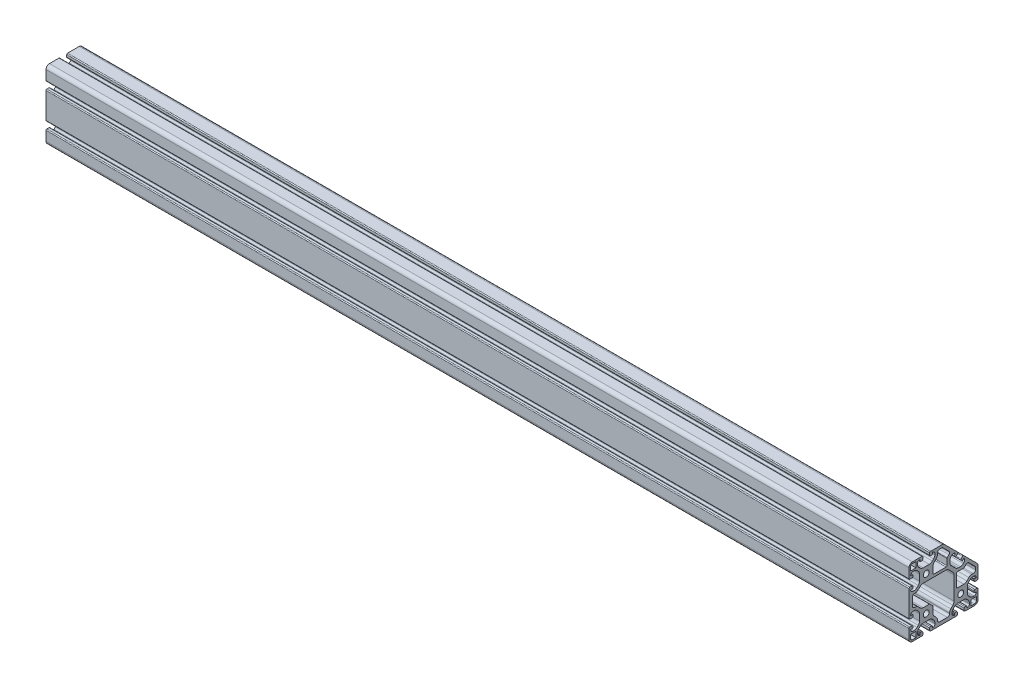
from build123d import *

# Parameters (mm, degrees)
MODEL_R                = 3.4
STRUKTURBAUTEIL1_DEPTH = 1000


with BuildPart() as part:
    # Model → Strukturbauteil1 (new body)
    with BuildSketch(Plane(origin=(0, 0, 0), x_dir=(0, 0, -1), z_dir=(1, 0, 0))):
        with BuildLine():
            Line((-29.214466, 27.093147), (-30.656855, 28.535538))
            ThreePointArc((-30.656855, 28.535538), (-32.278971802, 29.61939937), (-34.192388, 30))
            Line((-34.192388, 30), (-35.5, 30))
            ThreePointArc((-35.5, 30), (-37.267766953, 29.267766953), (-38, 27.5))
            Line((-38, 27.5), (-38, 27.449997))
            ThreePointArc((-38, 27.449997), (-37.868196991, 27.131800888), (-37.55, 27))
            Line((-37.55, 27), (-36, 27))
            ThreePointArc((-36, 27), (-35.646446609, 26.853553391), (-35.5, 26.5))
            Line((-35.5, 26.5), (-35.5, 25))
            ThreePointArc((-35.5, 25), (-35.792893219, 24.292893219), (-36.5, 24))
            Line((-36.5, 24), (-39, 24))
            ThreePointArc((-39, 24), (-39.707106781, 24.292893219), (-40, 25))
            Line((-40, 25), (-40, 36))
            ThreePointArc((-40, 36), (-38.828427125, 38.828427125), (-36, 40))
            Line((-36, 40), (-25, 40))
            ThreePointArc((-25, 40), (-24.292893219, 39.707106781), (-24, 39))
            Line((-24, 39), (-24, 36.5))
            ThreePointArc((-24, 36.5), (-24.292893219, 35.792893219), (-25, 35.5))
            Line((-25, 35.5), (-26.5, 35.5))
            ThreePointArc((-26.5, 35.5), (-26.853553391, 35.646446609), (-27, 36))
            Line((-27, 36), (-27, 37.550003))
            ThreePointArc((-27, 37.550003), (-27.131803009, 37.868199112), (-27.45, 38))
            Line((-27.45, 38), (-27.5, 38))
            ThreePointArc((-27.5, 38), (-29.267766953, 37.267766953), (-30, 35.5))
            Line((-30, 35.5), (-30, 34.19239))
            ThreePointArc((-30, 34.19239), (-29.619398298, 32.278971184), (-28.535534, 30.656853))
            Line((-28.535534, 30.656853), (-27.093145, 29.21447))
            ThreePointArc((-27.093145, 29.21447), (-25.471028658, 28.130604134), (-23.557611, 27.75))
            Line((-23.557611, 27.75), (-16.442389, 27.75))
            ThreePointArc((-16.442389, 27.75), (-14.528972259, 28.130600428), (-12.906855, 29.214462))
            Line((-12.906855, 29.214462), (-11.464466, 30.656853))
            ThreePointArc((-11.464466, 30.656853), (-10.380601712, 32.278971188), (-10, 34.19239))
            Line((-10, 34.19239), (-10, 35.5))
            ThreePointArc((-10, 35.5), (-10.732233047, 37.267766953), (-12.5, 38))
            Line((-12.5, 38), (-12.549999, 38))
            ThreePointArc((-12.549999, 38), (-12.868196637, 37.868199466), (-13, 37.550003))
            Line((-13, 37.550003), (-13, 36))
            ThreePointArc((-13, 36), (-13.146446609, 35.646446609), (-13.5, 35.5))
            Line((-13.5, 35.5), (-15, 35.5))
            ThreePointArc((-15, 35.5), (-15.707106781, 35.792893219), (-16, 36.5))
            Line((-16, 36.5), (-16, 39))
            ThreePointArc((-16, 39), (-15.707106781, 39.707106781), (-15, 40))
            Line((-15, 40), (-1.656853, 40))
            ThreePointArc((-1.656853, 40), (-0.126119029, 39.69551803), (1.171574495, 38.828426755))
            Line((1.171574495, 38.828426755), (16.464464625, 23.535532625))
            Line((16.464464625, 23.535532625), (16.462564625, 23.533632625))
            ThreePointArc((16.462564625, 23.533632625), (16.755458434, 22.826525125), (16.462564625, 22.119417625))
            Line((16.462564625, 22.119417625), (14.694796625, 20.351652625))
            ThreePointArc((14.694796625, 20.351652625), (13.987690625, 20.058760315), (13.280584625, 20.351652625))
            Line((13.280584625, 20.351652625), (12.219923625, 21.412313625))
            ThreePointArc((12.219923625, 21.412313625), (12.073478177, 21.765865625), (12.219923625, 22.119417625))
            Line((12.219923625, 22.119417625), (13.315939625, 23.215433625))
            ThreePointArc((13.315939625, 23.215433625), (13.447742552, 23.533632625), (13.315939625, 23.851831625))
            Line((13.315939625, 23.851831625), (13.280584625, 23.887186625))
            ThreePointArc((13.280584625, 23.887186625), (11.512817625, 24.619419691), (9.745050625, 23.887186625))
            Line((9.745050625, 23.887186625), (8.820429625, 22.962564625))
            ThreePointArc((8.820429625, 22.962564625), (7.736565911, 21.340447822), (7.355963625, 19.427030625))
            Line((7.355963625, 19.427030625), (7.355963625, 17.387186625))
            ThreePointArc((7.355963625, 17.387186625), (7.736565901, 15.473769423), (8.820429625, 13.851652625))
            Line((8.820429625, 13.851652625), (13.851652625, 8.820429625))
            ThreePointArc((13.851652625, 8.820429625), (15.473769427, 7.736565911), (17.387186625, 7.355963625))
            Line((17.387186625, 7.355963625), (19.427030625, 7.355963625))
            ThreePointArc((19.427030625, 7.355963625), (21.340447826, 7.736565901), (22.962564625, 8.820429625))
            Line((22.962564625, 8.820429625), (23.887186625, 9.745050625))
            ThreePointArc((23.887186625, 9.745050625), (24.619419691, 11.512817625), (23.887186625, 13.280584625))
            Line((23.887186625, 13.280584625), (23.851831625, 13.315939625))
            ThreePointArc((23.851831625, 13.315939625), (23.533632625, 13.447742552), (23.215433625, 13.315939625))
            Line((23.215433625, 13.315939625), (22.119417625, 12.219923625))
            ThreePointArc((22.119417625, 12.219923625), (21.765865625, 12.073478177), (21.412313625, 12.219923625))
            Line((21.412313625, 12.219923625), (20.351652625, 13.280584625))
            ThreePointArc((20.351652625, 13.280584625), (20.058760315, 13.987690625), (20.351652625, 14.694796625))
            Line((20.351652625, 14.694796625), (22.119417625, 16.462564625))
            ThreePointArc((22.119417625, 16.462564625), (22.826525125, 16.755458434), (23.533632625, 16.462564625))
            Line((23.533632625, 16.462564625), (23.535533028, 16.464465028))
            Line((23.535533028, 16.464465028), (38.828427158, 1.171574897))
            ThreePointArc((38.828427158, 1.171574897), (39.695518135, -0.12611818), (40, -1.656851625))
            Line((40, -1.656851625), (40, -15))
            ThreePointArc((40, -15), (39.707106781, -15.707106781), (39, -16))
            Line((39, -16), (36.5, -16))
            ThreePointArc((36.5, -16), (35.792893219, -15.707106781), (35.5, -15))
            Line((35.5, -15), (35.5, -13.5))
            ThreePointArc((35.5, -13.5), (35.646446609, -13.146446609), (36, -13))
            Line((36, -13), (37.550003, -13))
            ThreePointArc((37.550003, -13), (37.868199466, -12.868196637), (38, -12.549999))
            Line((38, -12.549999), (38, -12.5))
            ThreePointArc((38, -12.5), (37.267766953, -10.732233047), (35.5, -10))
            Line((35.5, -10), (34.19239, -10))
            ThreePointArc((34.19239, -10), (32.278971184, -10.380601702), (30.656853, -11.464466))
            Line((30.656853, -11.464466), (29.21447, -12.906855))
            ThreePointArc((29.21447, -12.906855), (28.130604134, -14.528971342), (27.75, -16.442389))
            Line((27.75, -16.442389), (27.75, -23.557611))
            ThreePointArc((27.75, -23.557611), (28.130600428, -25.471027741), (29.214462, -27.093145))
            Line((29.214462, -27.093145), (30.656853, -28.535534))
            ThreePointArc((30.656853, -28.535534), (32.278971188, -29.619398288), (34.19239, -30))
            Line((34.19239, -30), (35.5, -30))
            ThreePointArc((35.5, -30), (37.267766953, -29.267766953), (38, -27.5))
            Line((38, -27.5), (38, -27.45))
            ThreePointArc((38, -27.45), (37.868199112, -27.131803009), (37.550003, -27))
            Line((37.550003, -27), (36, -27))
            ThreePointArc((36, -27), (35.646446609, -26.853553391), (35.5, -26.5))
            Line((35.5, -26.5), (35.5, -25))
            ThreePointArc((35.5, -25), (35.792893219, -24.292893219), (36.5, -24))
            Line((36.5, -24), (39, -24))
            ThreePointArc((39, -24), (39.707106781, -24.292893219), (40, -25))
            Line((40, -25), (40, -36))
            ThreePointArc((40, -36), (38.828427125, -38.828427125), (36, -40))
            Line((36, -40), (25, -40))
            ThreePointArc((25, -40), (24.292893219, -39.707106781), (24, -39))
            Line((24, -39), (24, -36.5))
            ThreePointArc((24, -36.5), (24.292893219, -35.792893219), (25, -35.5))
            Line((25, -35.5), (26.5, -35.5))
            ThreePointArc((26.5, -35.5), (26.853553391, -35.646446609), (27, -36))
            Line((27, -36), (27, -37.55))
            ThreePointArc((27, -37.55), (27.131800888, -37.868196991), (27.449997, -38))
            Line((27.449997, -38), (27.5, -38))
            ThreePointArc((27.5, -38), (29.267766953, -37.267766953), (30, -35.5))
            Line((30, -35.5), (30, -34.192388))
            ThreePointArc((30, -34.192388), (29.61939938, -32.278971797), (28.535538, -30.656855))
            Line((28.535538, -30.656855), (27.093147, -29.214466))
            ThreePointArc((27.093147, -29.214466), (25.471030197, -28.130602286), (23.557613, -27.75))
            Line((23.557613, -27.75), (16.442387, -27.75))
            ThreePointArc((16.442387, -27.75), (14.528969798, -28.130602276), (12.906853, -29.214466))
            Line((12.906853, -29.214466), (11.464466, -30.656855))
            ThreePointArc((11.464466, -30.656855), (10.380602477, -32.278971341), (10, -34.192388))
            Line((10, -34.192388), (10, -35.5))
            ThreePointArc((10, -35.5), (10.732233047, -37.267766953), (12.5, -38))
            Line((12.5, -38), (12.549999, -38))
            ThreePointArc((12.549999, -38), (12.868197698, -37.868198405), (13, -37.55))
            Line((13, -37.55), (13, -36))
            ThreePointArc((13, -36), (13.146446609, -35.646446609), (13.5, -35.5))
            Line((13.5, -35.5), (15, -35.5))
            ThreePointArc((15, -35.5), (15.707106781, -35.792893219), (16, -36.5))
            Line((16, -36.5), (16, -39))
            ThreePointArc((16, -39), (15.707106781, -39.707106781), (15, -40))
            Line((15, -40), (-15, -40))
            ThreePointArc((-15, -40), (-15.707106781, -39.707106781), (-16, -39))
            Line((-16, -39), (-16, -36.5))
            ThreePointArc((-16, -36.5), (-15.707106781, -35.792893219), (-15, -35.5))
            Line((-15, -35.5), (-13.5, -35.5))
            ThreePointArc((-13.5, -35.5), (-13.146446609, -35.646446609), (-13, -36))
            Line((-13, -36), (-13, -37.55))
            ThreePointArc((-13, -37.55), (-12.868197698, -37.868198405), (-12.549999, -38))
            Line((-12.549999, -38), (-12.5, -38))
            ThreePointArc((-12.5, -38), (-10.732233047, -37.267766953), (-10, -35.5))
            Line((-10, -35.5), (-10, -34.192388))
            ThreePointArc((-10, -34.192388), (-10.380602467, -32.278971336), (-11.464466, -30.656855))
            Line((-11.464466, -30.656855), (-12.906855, -29.214466))
            ThreePointArc((-12.906855, -29.214466), (-14.528971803, -28.130602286), (-16.442389, -27.75))
            Line((-16.442389, -27.75), (-23.557611, -27.75))
            ThreePointArc((-23.557611, -27.75), (-25.471028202, -28.130602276), (-27.093145, -29.214466))
            Line((-27.093145, -29.214466), (-28.535534, -30.656855))
            ThreePointArc((-28.535534, -30.656855), (-29.619397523, -32.278971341), (-30, -34.192388))
            Line((-30, -34.192388), (-30, -35.5))
            ThreePointArc((-30, -35.5), (-29.267766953, -37.267766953), (-27.5, -38))
            Line((-27.5, -38), (-27.45, -38))
            ThreePointArc((-27.45, -38), (-27.131801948, -37.868198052), (-27, -37.55))
            Line((-27, -37.55), (-27, -36))
            ThreePointArc((-27, -36), (-26.853553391, -35.646446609), (-26.5, -35.5))
            Line((-26.5, -35.5), (-25, -35.5))
            ThreePointArc((-25, -35.5), (-24.292893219, -35.792893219), (-24, -36.5))
            Line((-24, -36.5), (-24, -39))
            ThreePointArc((-24, -39), (-24.292893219, -39.707106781), (-25, -40))
            Line((-25, -40), (-36, -40))
            ThreePointArc((-36, -40), (-38.828427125, -38.828427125), (-40, -36))
            Line((-40, -36), (-40, -25))
            ThreePointArc((-40, -25), (-39.707106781, -24.292893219), (-39, -24))
            Line((-39, -24), (-36.5, -24))
            ThreePointArc((-36.5, -24), (-35.792893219, -24.292893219), (-35.5, -25))
            Line((-35.5, -25), (-35.5, -26.5))
            ThreePointArc((-35.5, -26.5), (-35.646446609, -26.853553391), (-36, -27))
            Line((-36, -27), (-37.55, -27))
            ThreePointArc((-37.55, -27), (-37.868198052, -27.131801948), (-38, -27.45))
            Line((-38, -27.45), (-38, -27.5))
            ThreePointArc((-38, -27.5), (-37.267766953, -29.267766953), (-35.5, -30))
            Line((-35.5, -30), (-34.192388, -30))
            ThreePointArc((-34.192388, -30), (-32.278971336, -29.619397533), (-30.656855, -28.535534))
            Line((-30.656855, -28.535534), (-29.214466, -27.093145))
            ThreePointArc((-29.214466, -27.093145), (-28.130602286, -25.471028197), (-27.75, -23.557611))
            Line((-27.75, -23.557611), (-27.75, -16.442389))
            ThreePointArc((-27.75, -16.442389), (-28.130602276, -14.528971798), (-29.214466, -12.906855))
            Line((-29.214466, -12.906855), (-30.656855, -11.464466))
            ThreePointArc((-30.656855, -11.464466), (-32.278971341, -10.380602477), (-34.192388, -10))
            Line((-34.192388, -10), (-35.5, -10))
            ThreePointArc((-35.5, -10), (-37.267766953, -10.732233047), (-38, -12.5))
            Line((-38, -12.5), (-38, -12.549999))
            ThreePointArc((-38, -12.549999), (-37.868198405, -12.868197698), (-37.55, -13))
            Line((-37.55, -13), (-36, -13))
            ThreePointArc((-36, -13), (-35.646446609, -13.146446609), (-35.5, -13.5))
            Line((-35.5, -13.5), (-35.5, -15))
            ThreePointArc((-35.5, -15), (-35.792893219, -15.707106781), (-36.5, -16))
            Line((-36.5, -16), (-39, -16))
            ThreePointArc((-39, -16), (-39.707106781, -15.707106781), (-40, -15))
            Line((-40, -15), (-40, 15))
            ThreePointArc((-40, 15), (-39.707106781, 15.707106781), (-39, 16))
            Line((-39, 16), (-36.5, 16))
            ThreePointArc((-36.5, 16), (-35.792893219, 15.707106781), (-35.5, 15))
            Line((-35.5, 15), (-35.5, 13.5))
            ThreePointArc((-35.5, 13.5), (-35.646446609, 13.146446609), (-36, 13))
            Line((-36, 13), (-37.55, 13))
            ThreePointArc((-37.55, 13), (-37.868198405, 12.868197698), (-38, 12.549999))
            Line((-38, 12.549999), (-38, 12.5))
            ThreePointArc((-38, 12.5), (-37.267766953, 10.732233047), (-35.5, 10))
            Line((-35.5, 10), (-34.192388, 10))
            ThreePointArc((-34.192388, 10), (-32.278971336, 10.380602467), (-30.656855, 11.464466))
            Line((-30.656855, 11.464466), (-29.214466, 12.906853))
            ThreePointArc((-29.214466, 12.906853), (-28.130602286, 14.528969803), (-27.75, 16.442387))
            Line((-27.75, 16.442387), (-27.75, 23.557613))
            ThreePointArc((-27.75, 23.557613), (-28.130602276, 25.471030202), (-29.214466, 27.093147))
        make_face()
        with Locations((-20, -20)):
            Circle(MODEL_R, mode=Mode.SUBTRACT)
        with Locations((-20, 20)):
            Circle(MODEL_R, mode=Mode.SUBTRACT)
        with Locations((20, -20)):
            Circle(MODEL_R, mode=Mode.SUBTRACT)
        with BuildLine():
            Line((-8.464331, -29.418053), (-10.785398, -27.096985))
            ThreePointArc((-10.785398, -27.096985), (-11.869262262, -25.474868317), (-12.249865, -23.561451))
            Line((-12.249865, -23.561451), (-12.249865, -16.452324))
            ThreePointArc((-12.249865, -16.452324), (-12.325985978, -16.069640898), (-12.542759, -15.745218))
            Line((-12.542759, -15.745218), (-15.741243, -12.546734))
            ThreePointArc((-15.741243, -12.546734), (-16.065666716, -12.329960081), (-16.448351, -12.253839))
            Line((-16.448351, -12.253839), (-23.557484, -12.253839))
            ThreePointArc((-23.557484, -12.253839), (-25.470900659, -11.873236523), (-27.093017, -10.789373))
            Line((-27.093017, -10.789373), (-29.414082, -8.468309))
            ThreePointArc((-29.414082, -8.468309), (-31.036198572, -7.38444421), (-32.949616, -7.003841))
            Line((-32.949616, -7.003841), (-33.499868, -7.003841))
            ThreePointArc((-33.499868, -7.003841), (-35.267634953, -6.271607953), (-35.999868, -4.503841))
            Line((-35.999868, -4.503841), (-35.999868, 4.496159))
            ThreePointArc((-35.999868, 4.496159), (-35.267634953, 6.263925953), (-33.499868, 6.996159))
            Line((-33.499868, 6.996159), (-32.949616, 6.996159))
            ThreePointArc((-32.949616, 6.996159), (-31.036198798, 7.376761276), (-29.414082, 8.460625))
            Line((-29.414082, 8.460625), (-27.093014, 10.781693))
            ThreePointArc((-27.093014, 10.781693), (-25.470897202, 11.865556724), (-23.55748, 12.246159))
            Line((-23.55748, 12.246159), (2.698093, 12.246159))
            ThreePointArc((2.698093, 12.246159), (4.611510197, 11.865556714), (6.233627, 10.781693))
            Line((6.233627, 10.781693), (10.785667, 6.229652))
            ThreePointArc((10.785667, 6.229652), (11.869531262, 4.607535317), (12.250134, 2.694118))
            Line((12.250134, 2.694118), (12.250134, -23.561455))
            ThreePointArc((12.250134, -23.561455), (11.869531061, -25.474871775), (10.785667, -27.096988))
            Line((10.785667, -27.096988), (8.4646, -29.418053))
            ThreePointArc((8.4646, -29.418053), (7.380736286, -31.040169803), (7.000134, -32.953587))
            Line((7.000134, -32.953587), (7.000134, -33.50384))
            ThreePointArc((7.000134, -33.50384), (6.267900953, -35.271606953), (4.500134, -36.00384))
            Line((4.500134, -36.00384), (-4.499866, -36.00384))
            ThreePointArc((-4.499866, -36.00384), (-6.267632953, -35.271606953), (-6.999866, -33.50384))
            Line((-6.999866, -33.50384), (-6.999866, -32.953587))
            ThreePointArc((-6.999866, -32.953587), (-7.380467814, -31.040169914), (-8.464331, -29.418053))
        make_face(mode=Mode.SUBTRACT)
        with BuildLine():
            Line((36.26789862, -0.51424286), (29.545966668, 6.207472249))
            ThreePointArc((29.545966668, 6.207472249), (27.778185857, 6.93967968), (26.010428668, 6.207415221))
            Line((26.010428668, 6.207415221), (24.091941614, 4.288858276))
            ThreePointArc((24.091941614, 4.288858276), (23.767519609, 4.072080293), (23.384835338, 3.995954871))
            Line((23.384835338, 3.995954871), (16.250062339, 3.995839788))
            ThreePointArc((16.250062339, 3.995839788), (15.54295999, 3.702935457), (15.250078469, 2.995823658))
            Line((15.250078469, 2.995823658), (15.250308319, -11.25417834))
            ThreePointArc((15.250308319, -11.25417834), (15.543212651, -11.96128069), (16.250324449, -12.25416221))
            Line((16.250324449, -12.25416221), (23.557933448, -12.25404434))
            ThreePointArc((23.557933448, -12.25404434), (25.471344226, -11.873410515), (27.093443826, -10.789521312))
            Line((27.093443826, -10.789521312), (29.414474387, -8.468415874))
            ThreePointArc((29.414474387, -8.468415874), (31.036521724, -7.384517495), (32.949884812, -7.003840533))
            Line((32.949884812, -7.003840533), (34.500131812, -7.003840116))
            ThreePointArc((34.500131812, -7.003840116), (36.267899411, -6.271606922), (37.00013114, -4.503838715))
            Line((37.00013114, -4.503838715), (37.000129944, -2.282014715))
            ThreePointArc((37.000129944, -2.282014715), (36.809830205, -1.325303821), (36.26789862, -0.51424286))
        make_face(mode=Mode.SUBTRACT)
        with BuildLine():
            Line((6.211552, 29.542099), (-0.510277, 36.263924))
            ThreePointArc((-0.510277, 36.263924), (-1.321334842, 36.805854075), (-2.278042, 36.996155))
            Line((-2.278042, 36.996155), (-4.499866, 36.996155))
            ThreePointArc((-4.499866, 36.996155), (-6.267633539, 36.263922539), (-6.999866, 34.496155))
            Line((-6.999866, 34.496155), (-6.999866, 32.945908))
            ThreePointArc((-6.999866, 32.945908), (-7.380469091, 31.032488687), (-8.464334, 29.41037))
            Line((-8.464334, 29.41037), (-10.785402, 27.089302))
            ThreePointArc((-10.785402, 27.089302), (-11.869265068, 25.46718493), (-12.249868, 23.553768))
            Line((-12.249868, 23.553768), (-12.249868, 16.246159))
            ThreePointArc((-12.249868, 16.246159), (-11.956975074, 15.539051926), (-11.249868, 15.246159))
            Line((-11.249868, 15.246159), (3.000134, 15.246159))
            ThreePointArc((3.000134, 15.246159), (3.707241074, 15.539051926), (4.000134, 16.246159))
            Line((4.000134, 16.246159), (4.000134, 23.380936))
            ThreePointArc((4.000134, 23.380936), (4.076253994, 23.763619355), (4.293026, 24.088043))
            Line((4.293026, 24.088043), (6.211552, 26.006569))
            ThreePointArc((6.211552, 26.006569), (6.943783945, 27.774334), (6.211552, 29.542099))
        make_face(mode=Mode.SUBTRACT)
        with BuildLine():
            Line((31.800056, -38.203843), (36.000053, -38.203843))
            ThreePointArc((36.000053, -38.203843), (37.555691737, -37.559480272), (38.200058, -36.003843))
            Line((38.200058, -36.003843), (38.200058, -31.803843))
            Line((38.200058, -31.803843), (31.800056, -31.803843))
            Line((31.800056, -31.803843), (31.800056, -38.203843))
        make_face(mode=Mode.SUBTRACT)
        with BuildLine():
            Line((-35.999868, -38.203843), (-31.799869, -38.203843))
            Line((-31.799869, -38.203843), (-31.799869, -31.803843))
            Line((-31.799869, -31.803843), (-38.199868, -31.803843))
            Line((-38.199868, -31.803843), (-38.199868, -36.003843))
            ThreePointArc((-38.199868, -36.003843), (-37.555503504, -37.559478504), (-35.999868, -38.203843))
        make_face(mode=Mode.SUBTRACT)
        with BuildLine():
            Line((-38.199868, 31.796158), (-31.799869, 31.796158))
            Line((-31.799869, 31.796158), (-31.799869, 38.196159))
            Line((-31.799869, 38.196159), (-35.999868, 38.196159))
            ThreePointArc((-35.999868, 38.196159), (-37.555504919, 37.55179309), (-38.199868, 35.996155))
            Line((-38.199868, 35.996155), (-38.199868, 31.796158))
        make_face(mode=Mode.SUBTRACT)
    extrude(amount=STRUKTURBAUTEIL1_DEPTH)


solid = part.part
